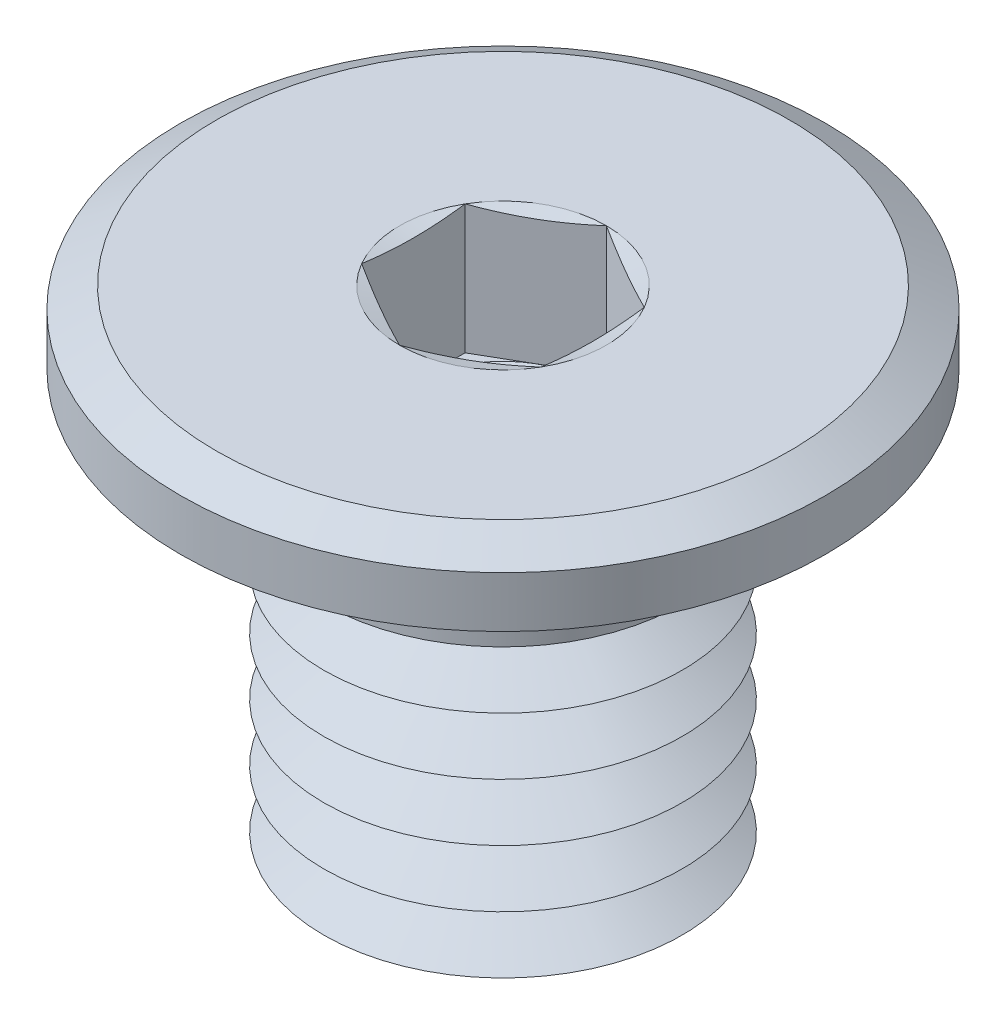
ISO-10303-21;
HEADER;
FILE_DESCRIPTION(('STEP AP214'),'2;1');
FILE_NAME('part.step','',(''),(''),'','','');
FILE_SCHEMA(('AUTOMOTIVE_DESIGN { 1 0 10303 214 1 1 1 1 }'));
ENDSEC;
DATA;
#1=APPLICATION_CONTEXT('core data for automotive mechanical design processes');
#2=APPLICATION_PROTOCOL_DEFINITION('international standard','automotive_design',2000,#1);
#3=PRODUCT_CONTEXT('',#1,'mechanical');
#4=PRODUCT('Part','Part','',(#3));
#5=PRODUCT_RELATED_PRODUCT_CATEGORY('part','',(#4));
#6=PRODUCT_DEFINITION_FORMATION('','',#4);
#7=PRODUCT_DEFINITION_CONTEXT('part definition',#1,'design');
#8=PRODUCT_DEFINITION('design','',#6,#7);
#9=PRODUCT_DEFINITION_SHAPE('','',#8);
#10=(LENGTH_UNIT() NAMED_UNIT(*) SI_UNIT(.MILLI.,.METRE.));
#11=(NAMED_UNIT(*) PLANE_ANGLE_UNIT() SI_UNIT($,.RADIAN.));
#12=(NAMED_UNIT(*) SI_UNIT($,.STERADIAN.) SOLID_ANGLE_UNIT());
#13=UNCERTAINTY_MEASURE_WITH_UNIT(LENGTH_MEASURE(1.E-05),#10,'distance_accuracy_value','');
#14=(GEOMETRIC_REPRESENTATION_CONTEXT(3) GLOBAL_UNCERTAINTY_ASSIGNED_CONTEXT((#13)) GLOBAL_UNIT_ASSIGNED_CONTEXT((#10,
#11,#12)) REPRESENTATION_CONTEXT('',''));
#15=CARTESIAN_POINT('',(0.,0.,0.));
#16=DIRECTION('',(0.,0.,1.));
#17=DIRECTION('',(1.,0.,0.));
#18=AXIS2_PLACEMENT_3D('',#15,#16,#17);
#19=CARTESIAN_POINT('',(0.,-5.8,0.));
#20=DIRECTION('',(0.,-1.,0.));
#21=DIRECTION('',(0.,0.,-1.));
#22=AXIS2_PLACEMENT_3D('',#19,#20,#21);
#23=CONICAL_SURFACE('',#22,2.5,1.0471975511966);
#24=CARTESIAN_POINT('',(0.,-5.4,0.));
#25=DIRECTION('',(0.,1.,0.));
#26=DIRECTION('',(0.,0.,1.));
#27=AXIS2_PLACEMENT_3D('',#24,#25,#26);
#28=CIRCLE('',#27,1.80717967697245);
#29=CARTESIAN_POINT('',(0.,-5.4,1.80717967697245));
#30=VERTEX_POINT('',#29);
#31=EDGE_CURVE('E403',#30,#30,#28,.T.);
#32=ORIENTED_EDGE('',*,*,#31,.F.);
#33=EDGE_LOOP('',(#32));
#34=FACE_BOUND('',#33,.T.);
#35=CARTESIAN_POINT('',(0.,-5.8,0.));
#36=DIRECTION('',(0.,1.,0.));
#37=DIRECTION('',(0.,0.,1.));
#38=AXIS2_PLACEMENT_3D('',#35,#36,#37);
#39=CIRCLE('',#38,2.5);
#40=CARTESIAN_POINT('',(0.,-5.8,2.5));
#41=VERTEX_POINT('',#40);
#42=EDGE_CURVE('E406',#41,#41,#39,.T.);
#43=ORIENTED_EDGE('',*,*,#42,.T.);
#44=EDGE_LOOP('',(#43));
#45=FACE_BOUND('',#44,.T.);
#46=ADVANCED_FACE('F39',(#34,#45),#23,.T.);
#47=CARTESIAN_POINT('',(0.,-5.4,0.));
#48=DIRECTION('',(0.,1.,0.));
#49=DIRECTION('',(0.,0.,1.));
#50=AXIS2_PLACEMENT_3D('',#47,#48,#49);
#51=CONICAL_SURFACE('',#50,1.80717967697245,1.0471975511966);
#52=CARTESIAN_POINT('',(0.,-5.,0.));
#53=DIRECTION('',(0.,1.,0.));
#54=DIRECTION('',(0.,0.,1.));
#55=AXIS2_PLACEMENT_3D('',#52,#53,#54);
#56=CIRCLE('',#55,2.5);
#57=CARTESIAN_POINT('',(0.,-5.,2.5));
#58=VERTEX_POINT('',#57);
#59=EDGE_CURVE('E399',#58,#58,#56,.T.);
#60=ORIENTED_EDGE('',*,*,#59,.F.);
#61=EDGE_LOOP('',(#60));
#62=FACE_BOUND('',#61,.T.);
#63=ORIENTED_EDGE('',*,*,#31,.T.);
#64=EDGE_LOOP('',(#63));
#65=FACE_BOUND('',#64,.T.);
#66=ADVANCED_FACE('F233',(#62,#65),#51,.T.);
#67=CARTESIAN_POINT('',(0.,-7.,0.));
#68=DIRECTION('',(0.,-1.,0.));
#69=DIRECTION('',(0.,0.,-1.));
#70=AXIS2_PLACEMENT_3D('',#67,#68,#69);
#71=PLANE('',#70);
#72=CARTESIAN_POINT('',(0.,-7.,0.));
#73=DIRECTION('',(0.,1.,0.));
#74=DIRECTION('',(0.,0.,1.));
#75=AXIS2_PLACEMENT_3D('',#72,#73,#74);
#76=CIRCLE('',#75,1.80717967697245);
#77=CARTESIAN_POINT('',(0.,-7.,1.80717967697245));
#78=VERTEX_POINT('',#77);
#79=EDGE_CURVE('E299',#78,#78,#76,.T.);
#80=ORIENTED_EDGE('',*,*,#79,.F.);
#81=EDGE_LOOP('',(#80));
#82=FACE_BOUND('',#81,.T.);
#83=ADVANCED_FACE('F239',(#82),#71,.T.);
#84=CARTESIAN_POINT('',(0.,-7.,0.));
#85=DIRECTION('',(0.,1.,0.));
#86=DIRECTION('',(0.,0.,1.));
#87=AXIS2_PLACEMENT_3D('',#84,#85,#86);
#88=CONICAL_SURFACE('',#87,1.80717967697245,1.0471975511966);
#89=CARTESIAN_POINT('',(0.,-6.6,0.));
#90=DIRECTION('',(0.,1.,0.));
#91=DIRECTION('',(0.,0.,1.));
#92=AXIS2_PLACEMENT_3D('',#89,#90,#91);
#93=CIRCLE('',#92,2.5);
#94=CARTESIAN_POINT('',(0.,-6.6,2.5));
#95=VERTEX_POINT('',#94);
#96=EDGE_CURVE('E414',#95,#95,#93,.T.);
#97=ORIENTED_EDGE('',*,*,#96,.F.);
#98=EDGE_LOOP('',(#97));
#99=FACE_BOUND('',#98,.T.);
#100=ORIENTED_EDGE('',*,*,#79,.T.);
#101=EDGE_LOOP('',(#100));
#102=FACE_BOUND('',#101,.T.);
#103=ADVANCED_FACE('F254',(#99,#102),#88,.T.);
#104=CARTESIAN_POINT('',(0.,-6.6,0.));
#105=DIRECTION('',(0.,-1.,0.));
#106=DIRECTION('',(0.,0.,-1.));
#107=AXIS2_PLACEMENT_3D('',#104,#105,#106);
#108=CONICAL_SURFACE('',#107,2.5,1.0471975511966);
#109=CARTESIAN_POINT('',(0.,-6.2,0.));
#110=DIRECTION('',(0.,1.,0.));
#111=DIRECTION('',(0.,0.,1.));
#112=AXIS2_PLACEMENT_3D('',#109,#110,#111);
#113=CIRCLE('',#112,1.80717967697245);
#114=CARTESIAN_POINT('',(0.,-6.2,1.80717967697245));
#115=VERTEX_POINT('',#114);
#116=EDGE_CURVE('E410',#115,#115,#113,.T.);
#117=ORIENTED_EDGE('',*,*,#116,.F.);
#118=EDGE_LOOP('',(#117));
#119=FACE_BOUND('',#118,.T.);
#120=ORIENTED_EDGE('',*,*,#96,.T.);
#121=EDGE_LOOP('',(#120));
#122=FACE_BOUND('',#121,.T.);
#123=ADVANCED_FACE('F250',(#119,#122),#108,.T.);
#124=CARTESIAN_POINT('',(0.,-6.2,0.));
#125=DIRECTION('',(0.,1.,0.));
#126=DIRECTION('',(0.,0.,1.));
#127=AXIS2_PLACEMENT_3D('',#124,#125,#126);
#128=CONICAL_SURFACE('',#127,1.80717967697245,1.0471975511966);
#129=ORIENTED_EDGE('',*,*,#42,.F.);
#130=EDGE_LOOP('',(#129));
#131=FACE_BOUND('',#130,.T.);
#132=ORIENTED_EDGE('',*,*,#116,.T.);
#133=EDGE_LOOP('',(#132));
#134=FACE_BOUND('',#133,.T.);
#135=ADVANCED_FACE('F246',(#131,#134),#128,.T.);
#136=CARTESIAN_POINT('',(0.,-5.,0.));
#137=DIRECTION('',(0.,-1.,0.));
#138=DIRECTION('',(0.,0.,-1.));
#139=AXIS2_PLACEMENT_3D('',#136,#137,#138);
#140=CONICAL_SURFACE('',#139,2.5,1.0471975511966);
#141=CARTESIAN_POINT('',(0.,-4.6,0.));
#142=DIRECTION('',(0.,1.,0.));
#143=DIRECTION('',(0.,0.,1.));
#144=AXIS2_PLACEMENT_3D('',#141,#142,#143);
#145=CIRCLE('',#144,1.80717967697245);
#146=CARTESIAN_POINT('',(0.,-4.6,1.80717967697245));
#147=VERTEX_POINT('',#146);
#148=EDGE_CURVE('E396',#147,#147,#145,.T.);
#149=ORIENTED_EDGE('',*,*,#148,.F.);
#150=EDGE_LOOP('',(#149));
#151=FACE_BOUND('',#150,.T.);
#152=ORIENTED_EDGE('',*,*,#59,.T.);
#153=EDGE_LOOP('',(#152));
#154=FACE_BOUND('',#153,.T.);
#155=ADVANCED_FACE('F249',(#151,#154),#140,.T.);
#156=CARTESIAN_POINT('',(0.,-4.6,0.));
#157=DIRECTION('',(0.,1.,0.));
#158=DIRECTION('',(0.,0.,1.));
#159=AXIS2_PLACEMENT_3D('',#156,#157,#158);
#160=CONICAL_SURFACE('',#159,1.80717967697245,1.0471975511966);
#161=CARTESIAN_POINT('',(0.,-4.2,0.));
#162=DIRECTION('',(0.,1.,0.));
#163=DIRECTION('',(0.,0.,1.));
#164=AXIS2_PLACEMENT_3D('',#161,#162,#163);
#165=CIRCLE('',#164,2.5);
#166=CARTESIAN_POINT('',(0.,-4.2,2.5));
#167=VERTEX_POINT('',#166);
#168=EDGE_CURVE('E392',#167,#167,#165,.T.);
#169=ORIENTED_EDGE('',*,*,#168,.F.);
#170=EDGE_LOOP('',(#169));
#171=FACE_BOUND('',#170,.T.);
#172=ORIENTED_EDGE('',*,*,#148,.T.);
#173=EDGE_LOOP('',(#172));
#174=FACE_BOUND('',#173,.T.);
#175=ADVANCED_FACE('F491',(#171,#174),#160,.T.);
#176=CARTESIAN_POINT('',(0.,-4.2,0.));
#177=DIRECTION('',(0.,-1.,0.));
#178=DIRECTION('',(0.,0.,-1.));
#179=AXIS2_PLACEMENT_3D('',#176,#177,#178);
#180=CONICAL_SURFACE('',#179,2.5,1.0471975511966);
#181=CARTESIAN_POINT('',(0.,-3.8,0.));
#182=DIRECTION('',(0.,1.,0.));
#183=DIRECTION('',(0.,0.,1.));
#184=AXIS2_PLACEMENT_3D('',#181,#182,#183);
#185=CIRCLE('',#184,1.80717967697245);
#186=CARTESIAN_POINT('',(0.,-3.8,1.80717967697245));
#187=VERTEX_POINT('',#186);
#188=EDGE_CURVE('E388',#187,#187,#185,.T.);
#189=ORIENTED_EDGE('',*,*,#188,.F.);
#190=EDGE_LOOP('',(#189));
#191=FACE_BOUND('',#190,.T.);
#192=ORIENTED_EDGE('',*,*,#168,.T.);
#193=EDGE_LOOP('',(#192));
#194=FACE_BOUND('',#193,.T.);
#195=ADVANCED_FACE('F487',(#191,#194),#180,.T.);
#196=CARTESIAN_POINT('',(0.,-3.8,0.));
#197=DIRECTION('',(0.,1.,0.));
#198=DIRECTION('',(0.,0.,1.));
#199=AXIS2_PLACEMENT_3D('',#196,#197,#198);
#200=CONICAL_SURFACE('',#199,1.80717967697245,1.0471975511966);
#201=CARTESIAN_POINT('',(0.,-3.4,0.));
#202=DIRECTION('',(0.,1.,0.));
#203=DIRECTION('',(0.,0.,1.));
#204=AXIS2_PLACEMENT_3D('',#201,#202,#203);
#205=CIRCLE('',#204,2.5);
#206=CARTESIAN_POINT('',(0.,-3.4,2.5));
#207=VERTEX_POINT('',#206);
#208=EDGE_CURVE('E384',#207,#207,#205,.T.);
#209=ORIENTED_EDGE('',*,*,#208,.F.);
#210=EDGE_LOOP('',(#209));
#211=FACE_BOUND('',#210,.T.);
#212=ORIENTED_EDGE('',*,*,#188,.T.);
#213=EDGE_LOOP('',(#212));
#214=FACE_BOUND('',#213,.T.);
#215=ADVANCED_FACE('F483',(#211,#214),#200,.T.);
#216=CARTESIAN_POINT('',(0.,-3.4,0.));
#217=DIRECTION('',(0.,-1.,0.));
#218=DIRECTION('',(0.,0.,-1.));
#219=AXIS2_PLACEMENT_3D('',#216,#217,#218);
#220=CONICAL_SURFACE('',#219,2.5,1.0471975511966);
#221=CARTESIAN_POINT('',(0.,-3.,0.));
#222=DIRECTION('',(0.,1.,0.));
#223=DIRECTION('',(0.,0.,1.));
#224=AXIS2_PLACEMENT_3D('',#221,#222,#223);
#225=CIRCLE('',#224,1.80717967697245);
#226=CARTESIAN_POINT('',(0.,-3.,1.80717967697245));
#227=VERTEX_POINT('',#226);
#228=EDGE_CURVE('E380',#227,#227,#225,.T.);
#229=ORIENTED_EDGE('',*,*,#228,.F.);
#230=EDGE_LOOP('',(#229));
#231=FACE_BOUND('',#230,.T.);
#232=ORIENTED_EDGE('',*,*,#208,.T.);
#233=EDGE_LOOP('',(#232));
#234=FACE_BOUND('',#233,.T.);
#235=ADVANCED_FACE('F479',(#231,#234),#220,.T.);
#236=CARTESIAN_POINT('',(0.,-3.,0.));
#237=DIRECTION('',(0.,1.,0.));
#238=DIRECTION('',(0.,0.,1.));
#239=AXIS2_PLACEMENT_3D('',#236,#237,#238);
#240=CONICAL_SURFACE('',#239,1.80717967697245,1.0471975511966);
#241=CARTESIAN_POINT('',(0.,-2.6,0.));
#242=DIRECTION('',(0.,1.,0.));
#243=DIRECTION('',(0.,0.,1.));
#244=AXIS2_PLACEMENT_3D('',#241,#242,#243);
#245=CIRCLE('',#244,2.5);
#246=CARTESIAN_POINT('',(0.,-2.6,2.5));
#247=VERTEX_POINT('',#246);
#248=EDGE_CURVE('E364',#247,#247,#245,.T.);
#249=ORIENTED_EDGE('',*,*,#248,.F.);
#250=EDGE_LOOP('',(#249));
#251=FACE_BOUND('',#250,.T.);
#252=ORIENTED_EDGE('',*,*,#228,.T.);
#253=EDGE_LOOP('',(#252));
#254=FACE_BOUND('',#253,.T.);
#255=ADVANCED_FACE('F274',(#251,#254),#240,.T.);
#256=CARTESIAN_POINT('',(0.,0.,0.));
#257=DIRECTION('',(0.,1.,0.));
#258=DIRECTION('',(0.,0.,1.));
#259=AXIS2_PLACEMENT_3D('',#256,#257,#258);
#260=PLANE('',#259);
#261=CARTESIAN_POINT('',(0.,0.,0.));
#262=DIRECTION('',(0.,1.,0.));
#263=DIRECTION('',(0.,0.,1.));
#264=AXIS2_PLACEMENT_3D('',#261,#262,#263);
#265=CIRCLE('',#264,1.44337567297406);
#266=CARTESIAN_POINT('',(0.,0.,1.44337567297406));
#267=VERTEX_POINT('',#266);
#268=CARTESIAN_POINT('',(1.25,0.,0.721687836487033));
#269=VERTEX_POINT('',#268);
#270=EDGE_CURVE('E66',#267,#269,#265,.T.);
#271=ORIENTED_EDGE('',*,*,#270,.F.);
#272=CARTESIAN_POINT('',(-1.25,0.,0.721687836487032));
#273=VERTEX_POINT('',#272);
#274=EDGE_CURVE('E169',#273,#267,#265,.T.);
#275=ORIENTED_EDGE('',*,*,#274,.F.);
#276=CARTESIAN_POINT('',(-1.25,0.,-0.721687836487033));
#277=VERTEX_POINT('',#276);
#278=EDGE_CURVE('E164',#277,#273,#265,.T.);
#279=ORIENTED_EDGE('',*,*,#278,.F.);
#280=CARTESIAN_POINT('',(0.,0.,-1.44337567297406));
#281=VERTEX_POINT('',#280);
#282=EDGE_CURVE('E128',#281,#277,#265,.T.);
#283=ORIENTED_EDGE('',*,*,#282,.F.);
#284=CARTESIAN_POINT('',(1.25,0.,-0.721687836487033));
#285=VERTEX_POINT('',#284);
#286=EDGE_CURVE('E119',#285,#281,#265,.T.);
#287=ORIENTED_EDGE('',*,*,#286,.F.);
#288=EDGE_CURVE('E59',#269,#285,#265,.T.);
#289=ORIENTED_EDGE('',*,*,#288,.F.);
#290=EDGE_LOOP('',(#271,#275,#279,#283,#287,#289));
#291=FACE_BOUND('',#290,.T.);
#292=CARTESIAN_POINT('',(0.,0.,0.));
#293=DIRECTION('',(0.,1.,0.));
#294=DIRECTION('',(0.,0.,1.));
#295=AXIS2_PLACEMENT_3D('',#292,#293,#294);
#296=CIRCLE('',#295,3.99999999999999);
#297=CARTESIAN_POINT('',(0.,0.,3.99999999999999));
#298=VERTEX_POINT('',#297);
#299=EDGE_CURVE('E295',#298,#298,#296,.T.);
#300=ORIENTED_EDGE('',*,*,#299,.T.);
#301=EDGE_LOOP('',(#300));
#302=FACE_BOUND('',#301,.T.);
#303=ADVANCED_FACE('F160',(#291,#302),#260,.T.);
#304=CARTESIAN_POINT('',(0.,-1.,0.));
#305=DIRECTION('',(0.,1.,0.));
#306=DIRECTION('',(0.,0.,1.));
#307=AXIS2_PLACEMENT_3D('',#304,#305,#306);
#308=CYLINDRICAL_SURFACE('',#307,4.5);
#309=CARTESIAN_POINT('',(0.,-0.288675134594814,0.));
#310=DIRECTION('',(0.,1.,0.));
#311=DIRECTION('',(0.,0.,1.));
#312=AXIS2_PLACEMENT_3D('',#309,#310,#311);
#313=CIRCLE('',#312,4.5);
#314=CARTESIAN_POINT('',(0.,-0.288675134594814,4.5));
#315=VERTEX_POINT('',#314);
#316=EDGE_CURVE('E306',#315,#315,#313,.F.);
#317=ORIENTED_EDGE('',*,*,#316,.T.);
#318=EDGE_LOOP('',(#317));
#319=FACE_BOUND('',#318,.T.);
#320=CARTESIAN_POINT('',(0.,-1.,0.));
#321=DIRECTION('',(0.,1.,0.));
#322=DIRECTION('',(0.,0.,1.));
#323=AXIS2_PLACEMENT_3D('',#320,#321,#322);
#324=CIRCLE('',#323,4.5);
#325=CARTESIAN_POINT('',(0.,-1.,4.5));
#326=VERTEX_POINT('',#325);
#327=EDGE_CURVE('E291',#326,#326,#324,.T.);
#328=ORIENTED_EDGE('',*,*,#327,.T.);
#329=EDGE_LOOP('',(#328));
#330=FACE_BOUND('',#329,.T.);
#331=ADVANCED_FACE('F270',(#319,#330),#308,.T.);
#332=CARTESIAN_POINT('',(0.,-1.,0.));
#333=DIRECTION('',(0.,1.,0.));
#334=DIRECTION('',(0.,0.,1.));
#335=AXIS2_PLACEMENT_3D('',#332,#333,#334);
#336=PLANE('',#335);
#337=CARTESIAN_POINT('',(0.,-1.,0.));
#338=DIRECTION('',(0.,1.,0.));
#339=DIRECTION('',(0.,0.,1.));
#340=AXIS2_PLACEMENT_3D('',#337,#338,#339);
#341=CIRCLE('',#340,2.7);
#342=CARTESIAN_POINT('',(0.,-1.,2.7));
#343=VERTEX_POINT('',#342);
#344=EDGE_CURVE('E286',#343,#343,#341,.T.);
#345=ORIENTED_EDGE('',*,*,#344,.T.);
#346=EDGE_LOOP('',(#345));
#347=FACE_BOUND('',#346,.T.);
#348=ORIENTED_EDGE('',*,*,#327,.F.);
#349=EDGE_LOOP('',(#348));
#350=FACE_BOUND('',#349,.T.);
#351=ADVANCED_FACE('F266',(#347,#350),#336,.F.);
#352=CARTESIAN_POINT('',(0.,-7.,0.));
#353=DIRECTION('',(0.,1.,0.));
#354=DIRECTION('',(0.,0.,1.));
#355=AXIS2_PLACEMENT_3D('',#352,#353,#354);
#356=CYLINDRICAL_SURFACE('',#355,2.5);
#357=CARTESIAN_POINT('',(0.,-1.2,0.));
#358=DIRECTION('',(0.,1.,0.));
#359=DIRECTION('',(0.,0.,1.));
#360=AXIS2_PLACEMENT_3D('',#357,#358,#359);
#361=CIRCLE('',#360,2.5);
#362=CARTESIAN_POINT('',(0.,-1.2,2.5));
#363=VERTEX_POINT('',#362);
#364=EDGE_CURVE('E289',#363,#363,#361,.F.);
#365=ORIENTED_EDGE('',*,*,#364,.T.);
#366=EDGE_LOOP('',(#365));
#367=FACE_BOUND('',#366,.T.);
#368=ORIENTED_EDGE('',*,*,#248,.T.);
#369=EDGE_LOOP('',(#368));
#370=FACE_BOUND('',#369,.T.);
#371=ADVANCED_FACE('F262',(#367,#370),#356,.T.);
#372=CARTESIAN_POINT('',(0.,-1.2,0.));
#373=DIRECTION('',(0.,1.,0.));
#374=DIRECTION('',(0.,0.,1.));
#375=AXIS2_PLACEMENT_3D('',#372,#373,#374);
#376=TOROIDAL_SURFACE('',#375,2.7,0.2);
#377=ORIENTED_EDGE('',*,*,#344,.F.);
#378=EDGE_LOOP('',(#377));
#379=FACE_BOUND('',#378,.T.);
#380=ORIENTED_EDGE('',*,*,#364,.F.);
#381=EDGE_LOOP('',(#380));
#382=FACE_BOUND('',#381,.T.);
#383=ADVANCED_FACE('F265',(#379,#382),#376,.F.);
#384=CARTESIAN_POINT('',(0.,0.,0.));
#385=DIRECTION('',(0.,-1.,0.));
#386=DIRECTION('',(0.,0.,-1.));
#387=AXIS2_PLACEMENT_3D('',#384,#385,#386);
#388=CONICAL_SURFACE('',#387,3.99999999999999,1.0471975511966);
#389=ORIENTED_EDGE('',*,*,#316,.F.);
#390=EDGE_LOOP('',(#389));
#391=FACE_BOUND('',#390,.T.);
#392=ORIENTED_EDGE('',*,*,#299,.F.);
#393=EDGE_LOOP('',(#392));
#394=FACE_BOUND('',#393,.T.);
#395=ADVANCED_FACE('F41',(#391,#394),#388,.T.);
#396=CARTESIAN_POINT('',(0.,0.,0.));
#397=DIRECTION('',(0.,1.,0.));
#398=DIRECTION('',(0.,0.,1.));
#399=AXIS2_PLACEMENT_3D('',#396,#397,#398);
#400=CONICAL_SURFACE('',#399,1.44337567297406,1.30899693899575);
#401=ORIENTED_EDGE('',*,*,#282,.T.);
#402=CARTESIAN_POINT('',(0.000199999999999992,3.094382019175E-05,-1.4434911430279));
#403=CARTESIAN_POINT('',(-0.0517259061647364,-0.00800698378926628,-1.41351170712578));
#404=CARTESIAN_POINT('',(-0.103745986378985,-0.0153042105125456,-1.38347789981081));
#405=CARTESIAN_POINT('',(-0.207969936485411,-0.028124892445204,-1.32330417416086));
#406=CARTESIAN_POINT('',(-0.260173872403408,-0.0336476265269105,-1.29316421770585));
#407=CARTESIAN_POINT('',(-0.36444888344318,-0.0425967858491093,-1.23296101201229));
#408=CARTESIAN_POINT('',(-0.416519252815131,-0.0460338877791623,-1.20289817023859));
#409=CARTESIAN_POINT('',(-0.520726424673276,-0.0506427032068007,-1.1427341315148));
#410=CARTESIAN_POINT('',(-0.572863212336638,-0.0518148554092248,-1.11263294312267));
#411=CARTESIAN_POINT('',(-0.677136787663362,-0.0518148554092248,-1.05243056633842));
#412=CARTESIAN_POINT('',(-0.729273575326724,-0.0506427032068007,-1.0223293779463));
#413=CARTESIAN_POINT('',(-0.833480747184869,-0.0460338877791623,-0.96216533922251));
#414=CARTESIAN_POINT('',(-0.88555111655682,-0.0425967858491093,-0.932102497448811));
#415=CARTESIAN_POINT('',(-0.989826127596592,-0.0336476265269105,-0.871899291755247));
#416=CARTESIAN_POINT('',(-1.04203006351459,-0.028124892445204,-0.841759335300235));
#417=CARTESIAN_POINT('',(-1.14625401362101,-0.0153042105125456,-0.781585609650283));
#418=CARTESIAN_POINT('',(-1.19827409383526,-0.0080069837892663,-0.751551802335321));
#419=CARTESIAN_POINT('',(-1.2502,3.09438201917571E-05,-0.721572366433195));
#420=B_SPLINE_CURVE_WITH_KNOTS('',3,(#402,#403,#404,#405,#406,#407,#408,#409,#410,#411,#412,
#413,#414,#415,#416,#417,#418,#419),.UNSPECIFIED.,.F.,.F.,(4,2,2,2,2,2,2,2,4),(0.,
0.18149525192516,0.363064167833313,0.543695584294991,0.724292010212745,0.904888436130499,
1.08551985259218,1.26708876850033,1.44858402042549),.UNSPECIFIED.);
#421=EDGE_CURVE('E11',#281,#277,#420,.T.);
#422=ORIENTED_EDGE('',*,*,#421,.F.);
#423=EDGE_LOOP('',(#401,#422));
#424=FACE_BOUND('',#423,.T.);
#425=ADVANCED_FACE('F132',(#424),#400,.F.);
#426=ORIENTED_EDGE('',*,*,#278,.T.);
#427=CARTESIAN_POINT('',(-1.25,0.295017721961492,-2.21618029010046));
#428=CARTESIAN_POINT('',(-1.25,0.270123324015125,-2.10936606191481));
#429=CARTESIAN_POINT('',(-1.25,0.245578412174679,-2.00246488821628));
#430=CARTESIAN_POINT('',(-1.25,0.197670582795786,-1.78837821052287));
#431=CARTESIAN_POINT('',(-1.25,0.174307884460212,-1.6811926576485));
#432=CARTESIAN_POINT('',(-1.25,0.129037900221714,-1.46542158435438));
#433=CARTESIAN_POINT('',(-1.25,0.107146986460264,-1.35683258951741));
#434=CARTESIAN_POINT('',(-1.25,0.0659326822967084,-1.13914880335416));
#435=CARTESIAN_POINT('',(-1.25,0.0466095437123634,-1.03005396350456));
#436=CARTESIAN_POINT('',(-1.25,0.0123179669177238,-0.814238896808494));
#437=CARTESIAN_POINT('',(-1.25,-0.00275558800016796,-0.707535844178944));
#438=CARTESIAN_POINT('',(-1.25,-0.0275791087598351,-0.493517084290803));
#439=CARTESIAN_POINT('',(-1.25,-0.0373307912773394,-0.386201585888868));
#440=CARTESIAN_POINT('',(-1.25,-0.0498256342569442,-0.171630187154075));
#441=CARTESIAN_POINT('',(-1.25,-0.052600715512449,-0.064376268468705));
#442=CARTESIAN_POINT('',(-1.25,-0.0506356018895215,0.15006745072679));
#443=CARTESIAN_POINT('',(-1.25,-0.0458948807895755,0.257257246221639));
#444=CARTESIAN_POINT('',(-1.25,-0.0320967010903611,0.441548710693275));
#445=CARTESIAN_POINT('',(-1.25,-0.0245948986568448,0.518776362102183));
#446=CARTESIAN_POINT('',(-1.25,-0.0068236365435,0.672906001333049));
#447=CARTESIAN_POINT('',(-1.25,0.00344575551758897,0.749807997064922));
#448=CARTESIAN_POINT('',(-1.25,0.0261652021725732,0.903544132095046));
#449=CARTESIAN_POINT('',(-1.25,0.0386223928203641,0.980377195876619));
#450=CARTESIAN_POINT('',(-1.25,0.0651615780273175,1.13376313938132));
#451=CARTESIAN_POINT('',(-1.25,0.0792436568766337,1.21031600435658));
#452=CARTESIAN_POINT('',(-1.25,0.108934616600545,1.36480056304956));
#453=CARTESIAN_POINT('',(-1.25,0.124569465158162,1.44272722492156));
#454=CARTESIAN_POINT('',(-1.25,0.156788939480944,1.59838383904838));
#455=CARTESIAN_POINT('',(-1.25,0.173373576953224,1.67611378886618));
#456=CARTESIAN_POINT('',(-1.25,0.2071623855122,1.83097242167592));
#457=CARTESIAN_POINT('',(-1.25,0.224362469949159,1.90810200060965));
#458=CARTESIAN_POINT('',(-1.25,0.259314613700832,2.06223034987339));
#459=CARTESIAN_POINT('',(-1.25,0.277066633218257,2.13922912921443));
#460=CARTESIAN_POINT('',(-1.25,0.295017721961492,2.21618029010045));
#461=B_SPLINE_CURVE_WITH_KNOTS('',3,(#427,#428,#429,#430,#431,#432,#433,#434,#435,#436,#437,
#438,#439,#440,#441,#442,#443,#444,#445,#446,#447,#448,#449,#450,#451,#452,#453,#454,#455,#456,
#457,#458,#459,#460),.UNSPECIFIED.,.F.,.F.,(4,2,2,2,2,2,2,2,2,2,2,2,2,2,2,2,4),(0.,
0.329038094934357,0.658136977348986,0.990437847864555,1.32277128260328,1.64596801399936,
1.96906043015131,2.29067185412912,2.61230579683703,2.84502466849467,3.07773785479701,
3.3112246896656,3.54472364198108,3.78315484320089,4.02158898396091,4.2586591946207,
4.49571235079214),.UNSPECIFIED.);
#462=EDGE_CURVE('E172',#277,#273,#461,.T.);
#463=ORIENTED_EDGE('',*,*,#462,.F.);
#464=EDGE_LOOP('',(#426,#463));
#465=FACE_BOUND('',#464,.T.);
#466=ADVANCED_FACE('F438',(#465),#400,.F.);
#467=ORIENTED_EDGE('',*,*,#274,.T.);
#468=CARTESIAN_POINT('',(-1.2502,3.09438201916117E-05,0.721572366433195));
#469=CARTESIAN_POINT('',(-1.19827409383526,-0.00800698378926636,0.75155180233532));
#470=CARTESIAN_POINT('',(-1.14625401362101,-0.0153042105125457,0.781585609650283));
#471=CARTESIAN_POINT('',(-1.04203006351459,-0.0281248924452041,0.841759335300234));
#472=CARTESIAN_POINT('',(-0.989826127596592,-0.0336476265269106,0.871899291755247));
#473=CARTESIAN_POINT('',(-0.88555111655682,-0.0425967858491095,0.932102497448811));
#474=CARTESIAN_POINT('',(-0.833480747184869,-0.0460338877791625,0.96216533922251));
#475=CARTESIAN_POINT('',(-0.729273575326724,-0.0506427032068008,1.0223293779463));
#476=CARTESIAN_POINT('',(-0.677136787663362,-0.051814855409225,1.05243056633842));
#477=CARTESIAN_POINT('',(-0.572863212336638,-0.0518148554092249,1.11263294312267));
#478=CARTESIAN_POINT('',(-0.520726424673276,-0.0506427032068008,1.1427341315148));
#479=CARTESIAN_POINT('',(-0.416519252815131,-0.0460338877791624,1.20289817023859));
#480=CARTESIAN_POINT('',(-0.36444888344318,-0.0425967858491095,1.23296101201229));
#481=CARTESIAN_POINT('',(-0.260173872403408,-0.0336476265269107,1.29316421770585));
#482=CARTESIAN_POINT('',(-0.207969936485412,-0.0281248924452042,1.32330417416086));
#483=CARTESIAN_POINT('',(-0.103745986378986,-0.0153042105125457,1.38347789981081));
#484=CARTESIAN_POINT('',(-0.0517259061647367,-0.00800698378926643,1.41351170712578));
#485=CARTESIAN_POINT('',(0.000199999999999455,3.09438201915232E-05,1.4434911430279));
#486=B_SPLINE_CURVE_WITH_KNOTS('',3,(#468,#469,#470,#471,#472,#473,#474,#475,#476,#477,#478,
#479,#480,#481,#482,#483,#484,#485),.UNSPECIFIED.,.F.,.F.,(4,2,2,2,2,2,2,2,4),(0.,
0.18149525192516,0.363064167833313,0.543695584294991,0.724292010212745,0.904888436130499,
1.08551985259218,1.26708876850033,1.44858402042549),.UNSPECIFIED.);
#487=EDGE_CURVE('E180',#273,#267,#486,.T.);
#488=ORIENTED_EDGE('',*,*,#487,.F.);
#489=EDGE_LOOP('',(#467,#488));
#490=FACE_BOUND('',#489,.T.);
#491=ADVANCED_FACE('F436',(#490),#400,.F.);
#492=ORIENTED_EDGE('',*,*,#270,.T.);
#493=CARTESIAN_POINT('',(-0.00020000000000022,3.09438201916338E-05,1.4434911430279));
#494=CARTESIAN_POINT('',(0.0517259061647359,-0.00800698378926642,1.41351170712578));
#495=CARTESIAN_POINT('',(0.103745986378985,-0.0153042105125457,1.38347789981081));
#496=CARTESIAN_POINT('',(0.207969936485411,-0.0281248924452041,1.32330417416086));
#497=CARTESIAN_POINT('',(0.260173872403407,-0.0336476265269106,1.29316421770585));
#498=CARTESIAN_POINT('',(0.36444888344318,-0.0425967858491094,1.23296101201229));
#499=CARTESIAN_POINT('',(0.416519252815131,-0.0460338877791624,1.20289817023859));
#500=CARTESIAN_POINT('',(0.520726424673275,-0.0506427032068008,1.1427341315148));
#501=CARTESIAN_POINT('',(0.572863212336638,-0.0518148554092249,1.11263294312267));
#502=CARTESIAN_POINT('',(0.677136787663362,-0.0518148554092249,1.05243056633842));
#503=CARTESIAN_POINT('',(0.729273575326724,-0.0506427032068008,1.0223293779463));
#504=CARTESIAN_POINT('',(0.833480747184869,-0.0460338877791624,0.96216533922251));
#505=CARTESIAN_POINT('',(0.88555111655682,-0.0425967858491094,0.932102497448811));
#506=CARTESIAN_POINT('',(0.989826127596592,-0.0336476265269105,0.871899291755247));
#507=CARTESIAN_POINT('',(1.04203006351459,-0.028124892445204,0.841759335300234));
#508=CARTESIAN_POINT('',(1.14625401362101,-0.0153042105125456,0.781585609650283));
#509=CARTESIAN_POINT('',(1.19827409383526,-0.00800698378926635,0.751551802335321));
#510=CARTESIAN_POINT('',(1.2502,3.09438201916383E-05,0.721572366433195));
#511=B_SPLINE_CURVE_WITH_KNOTS('',3,(#493,#494,#495,#496,#497,#498,#499,#500,#501,#502,#503,
#504,#505,#506,#507,#508,#509,#510),.UNSPECIFIED.,.F.,.F.,(4,2,2,2,2,2,2,2,4),(0.,
0.18149525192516,0.363064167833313,0.543695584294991,0.724292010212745,0.904888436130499,
1.08551985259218,1.26708876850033,1.44858402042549),.UNSPECIFIED.);
#512=EDGE_CURVE('E199',#267,#269,#511,.T.);
#513=ORIENTED_EDGE('',*,*,#512,.F.);
#514=EDGE_LOOP('',(#492,#513));
#515=FACE_BOUND('',#514,.T.);
#516=ADVANCED_FACE('F561',(#515),#400,.F.);
#517=ORIENTED_EDGE('',*,*,#288,.T.);
#518=CARTESIAN_POINT('',(1.25,0.295017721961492,2.21618029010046));
#519=CARTESIAN_POINT('',(1.25,0.270123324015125,2.10936606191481));
#520=CARTESIAN_POINT('',(1.25,0.245578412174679,2.00246488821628));
#521=CARTESIAN_POINT('',(1.25,0.197670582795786,1.78837821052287));
#522=CARTESIAN_POINT('',(1.25,0.174307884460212,1.6811926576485));
#523=CARTESIAN_POINT('',(1.25,0.129037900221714,1.46542158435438));
#524=CARTESIAN_POINT('',(1.25,0.107146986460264,1.35683258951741));
#525=CARTESIAN_POINT('',(1.25,0.0659326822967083,1.13914880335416));
#526=CARTESIAN_POINT('',(1.25,0.0466095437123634,1.03005396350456));
#527=CARTESIAN_POINT('',(1.25,0.0123179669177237,0.814238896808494));
#528=CARTESIAN_POINT('',(1.25,-0.00275558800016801,0.707535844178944));
#529=CARTESIAN_POINT('',(1.25,-0.0275791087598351,0.493517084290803));
#530=CARTESIAN_POINT('',(1.25,-0.0373307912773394,0.386201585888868));
#531=CARTESIAN_POINT('',(1.25,-0.0498256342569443,0.171630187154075));
#532=CARTESIAN_POINT('',(1.25,-0.052600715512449,0.064376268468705));
#533=CARTESIAN_POINT('',(1.25,-0.0506356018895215,-0.15006745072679));
#534=CARTESIAN_POINT('',(1.25,-0.0458948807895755,-0.257257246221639));
#535=CARTESIAN_POINT('',(1.25,-0.0320967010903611,-0.441548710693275));
#536=CARTESIAN_POINT('',(1.25,-0.0245948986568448,-0.518776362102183));
#537=CARTESIAN_POINT('',(1.25,-0.0068236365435,-0.672906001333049));
#538=CARTESIAN_POINT('',(1.25,0.00344575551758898,-0.749807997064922));
#539=CARTESIAN_POINT('',(1.25,0.0261652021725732,-0.903544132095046));
#540=CARTESIAN_POINT('',(1.25,0.0386223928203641,-0.980377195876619));
#541=CARTESIAN_POINT('',(1.25,0.0651615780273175,-1.13376313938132));
#542=CARTESIAN_POINT('',(1.25,0.0792436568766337,-1.21031600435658));
#543=CARTESIAN_POINT('',(1.25,0.108934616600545,-1.36480056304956));
#544=CARTESIAN_POINT('',(1.25,0.124569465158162,-1.44272722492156));
#545=CARTESIAN_POINT('',(1.25,0.156788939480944,-1.59838383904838));
#546=CARTESIAN_POINT('',(1.25,0.173373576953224,-1.67611378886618));
#547=CARTESIAN_POINT('',(1.25,0.2071623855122,-1.83097242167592));
#548=CARTESIAN_POINT('',(1.25,0.224362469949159,-1.90810200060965));
#549=CARTESIAN_POINT('',(1.25,0.259314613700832,-2.06223034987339));
#550=CARTESIAN_POINT('',(1.25,0.277066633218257,-2.13922912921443));
#551=CARTESIAN_POINT('',(1.25,0.295017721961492,-2.21618029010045));
#552=B_SPLINE_CURVE_WITH_KNOTS('',3,(#518,#519,#520,#521,#522,#523,#524,#525,#526,#527,#528,
#529,#530,#531,#532,#533,#534,#535,#536,#537,#538,#539,#540,#541,#542,#543,#544,#545,#546,#547,
#548,#549,#550,#551),.UNSPECIFIED.,.F.,.F.,(4,2,2,2,2,2,2,2,2,2,2,2,2,2,2,2,4),(0.,
0.329038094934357,0.658136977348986,0.990437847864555,1.32277128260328,1.64596801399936,
1.96906043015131,2.29067185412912,2.61230579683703,2.84502466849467,3.07773785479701,
3.3112246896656,3.54472364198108,3.78315484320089,4.02158898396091,4.2586591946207,
4.49571235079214),.UNSPECIFIED.);
#553=EDGE_CURVE('E149',#269,#285,#552,.T.);
#554=ORIENTED_EDGE('',*,*,#553,.F.);
#555=EDGE_LOOP('',(#517,#554));
#556=FACE_BOUND('',#555,.T.);
#557=ADVANCED_FACE('F192',(#556),#400,.F.);
#558=ORIENTED_EDGE('',*,*,#286,.T.);
#559=CARTESIAN_POINT('',(1.2502,3.09438201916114E-05,-0.721572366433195));
#560=CARTESIAN_POINT('',(1.19827409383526,-0.00800698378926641,-0.75155180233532));
#561=CARTESIAN_POINT('',(1.14625401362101,-0.0153042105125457,-0.781585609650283));
#562=CARTESIAN_POINT('',(1.04203006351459,-0.0281248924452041,-0.841759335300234));
#563=CARTESIAN_POINT('',(0.989826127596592,-0.0336476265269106,-0.871899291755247));
#564=CARTESIAN_POINT('',(0.88555111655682,-0.0425967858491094,-0.932102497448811));
#565=CARTESIAN_POINT('',(0.833480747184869,-0.0460338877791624,-0.96216533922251));
#566=CARTESIAN_POINT('',(0.729273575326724,-0.0506427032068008,-1.0223293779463));
#567=CARTESIAN_POINT('',(0.677136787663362,-0.0518148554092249,-1.05243056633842));
#568=CARTESIAN_POINT('',(0.572863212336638,-0.0518148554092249,-1.11263294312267));
#569=CARTESIAN_POINT('',(0.520726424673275,-0.0506427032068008,-1.1427341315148));
#570=CARTESIAN_POINT('',(0.416519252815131,-0.0460338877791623,-1.20289817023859));
#571=CARTESIAN_POINT('',(0.36444888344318,-0.0425967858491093,-1.23296101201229));
#572=CARTESIAN_POINT('',(0.260173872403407,-0.0336476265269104,-1.29316421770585));
#573=CARTESIAN_POINT('',(0.207969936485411,-0.0281248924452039,-1.32330417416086));
#574=CARTESIAN_POINT('',(0.103745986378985,-0.0153042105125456,-1.38347789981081));
#575=CARTESIAN_POINT('',(0.051725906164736,-0.00800698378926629,-1.41351170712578));
#576=CARTESIAN_POINT('',(-0.000200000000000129,3.0943820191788E-05,-1.4434911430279));
#577=B_SPLINE_CURVE_WITH_KNOTS('',3,(#559,#560,#561,#562,#563,#564,#565,#566,#567,#568,#569,
#570,#571,#572,#573,#574,#575,#576),.UNSPECIFIED.,.F.,.F.,(4,2,2,2,2,2,2,2,4),(0.,
0.18149525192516,0.363064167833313,0.543695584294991,0.724292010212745,0.9048884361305,
1.08551985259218,1.26708876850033,1.44858402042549),.UNSPECIFIED.);
#578=EDGE_CURVE('E123',#285,#281,#577,.T.);
#579=ORIENTED_EDGE('',*,*,#578,.F.);
#580=EDGE_LOOP('',(#558,#579));
#581=FACE_BOUND('',#580,.T.);
#582=ADVANCED_FACE('F121',(#581),#400,.F.);
#583=CARTESIAN_POINT('',(0.,-1.8,0.));
#584=DIRECTION('',(0.,1.,0.));
#585=DIRECTION('',(0.,0.,1.));
#586=AXIS2_PLACEMENT_3D('',#583,#584,#585);
#587=CONICAL_SURFACE('',#586,1.25,1.0471975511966);
#588=CARTESIAN_POINT('',(0.,-2.52168783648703,0.));
#589=VERTEX_POINT('',#588);
#590=VERTEX_LOOP('',#589);
#591=FACE_BOUND('',#590,.T.);
#592=CARTESIAN_POINT('',(0.,-1.8,0.));
#593=DIRECTION('',(0.,1.,0.));
#594=DIRECTION('',(0.,0.,1.));
#595=AXIS2_PLACEMENT_3D('',#592,#593,#594);
#596=CIRCLE('',#595,1.25);
#597=CARTESIAN_POINT('',(0.624999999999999,-1.8,1.08253175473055));
#598=VERTEX_POINT('',#597);
#599=CARTESIAN_POINT('',(1.25,-1.8,0.));
#600=VERTEX_POINT('',#599);
#601=EDGE_CURVE('E148',#598,#600,#596,.T.);
#602=ORIENTED_EDGE('',*,*,#601,.T.);
#603=CARTESIAN_POINT('',(0.,-1.8,0.));
#604=DIRECTION('',(0.,1.,0.));
#605=DIRECTION('',(0.,0.,1.));
#606=AXIS2_PLACEMENT_3D('',#603,#604,#605);
#607=CIRCLE('',#606,1.25);
#608=CARTESIAN_POINT('',(0.625,-1.8,-1.08253175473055));
#609=VERTEX_POINT('',#608);
#610=EDGE_CURVE('E53',#600,#609,#607,.T.);
#611=ORIENTED_EDGE('',*,*,#610,.T.);
#612=CARTESIAN_POINT('',(-0.625,-1.8,-1.08253175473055));
#613=VERTEX_POINT('',#612);
#614=EDGE_CURVE('E320',#609,#613,#607,.T.);
#615=ORIENTED_EDGE('',*,*,#614,.T.);
#616=CARTESIAN_POINT('',(-1.25,-1.8,0.));
#617=VERTEX_POINT('',#616);
#618=EDGE_CURVE('E318',#613,#617,#607,.T.);
#619=ORIENTED_EDGE('',*,*,#618,.T.);
#620=CARTESIAN_POINT('',(-0.625,-1.8,1.08253175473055));
#621=VERTEX_POINT('',#620);
#622=EDGE_CURVE('E311',#617,#621,#607,.T.);
#623=ORIENTED_EDGE('',*,*,#622,.T.);
#624=EDGE_CURVE('E309',#621,#598,#607,.T.);
#625=ORIENTED_EDGE('',*,*,#624,.T.);
#626=EDGE_LOOP('',(#602,#611,#615,#619,#623,#625));
#627=FACE_BOUND('',#626,.T.);
#628=ADVANCED_FACE('F191',(#591,#627),#587,.F.);
#629=CARTESIAN_POINT('',(0.,-1.8,0.));
#630=DIRECTION('',(0.,1.,0.));
#631=DIRECTION('',(0.,0.,1.));
#632=AXIS2_PLACEMENT_3D('',#629,#630,#631);
#633=PLANE('',#632);
#634=ORIENTED_EDGE('',*,*,#610,.F.);
#635=DIRECTION('',(0.,0.,-1.));
#636=VECTOR('',#635,1.);
#637=CARTESIAN_POINT('',(1.25,-1.8,0.721687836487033));
#638=LINE('',#637,#636);
#639=CARTESIAN_POINT('',(1.25,-1.8,-0.721687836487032));
#640=VERTEX_POINT('',#639);
#641=EDGE_CURVE('E359',#600,#640,#638,.T.);
#642=ORIENTED_EDGE('',*,*,#641,.T.);
#643=DIRECTION('',(-0.866025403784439,0.,-0.5));
#644=VECTOR('',#643,1.);
#645=CARTESIAN_POINT('',(1.25,-1.8,-0.721687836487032));
#646=LINE('',#645,#644);
#647=EDGE_CURVE('E440',#640,#609,#646,.T.);
#648=ORIENTED_EDGE('',*,*,#647,.T.);
#649=EDGE_LOOP('',(#634,#642,#648));
#650=FACE_BOUND('',#649,.T.);
#651=ADVANCED_FACE('F446',(#650),#633,.T.);
#652=ORIENTED_EDGE('',*,*,#601,.F.);
#653=DIRECTION('',(0.866025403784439,0.,-0.5));
#654=VECTOR('',#653,1.);
#655=CARTESIAN_POINT('',(0.,-1.8,1.44337567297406));
#656=LINE('',#655,#654);
#657=CARTESIAN_POINT('',(1.25,-1.8,0.721687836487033));
#658=VERTEX_POINT('',#657);
#659=EDGE_CURVE('E354',#598,#658,#656,.T.);
#660=ORIENTED_EDGE('',*,*,#659,.T.);
#661=EDGE_CURVE('E157',#658,#600,#638,.T.);
#662=ORIENTED_EDGE('',*,*,#661,.T.);
#663=EDGE_LOOP('',(#652,#660,#662));
#664=FACE_BOUND('',#663,.T.);
#665=ADVANCED_FACE('F448',(#664),#633,.T.);
#666=ORIENTED_EDGE('',*,*,#624,.F.);
#667=DIRECTION('',(0.866025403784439,0.,0.5));
#668=VECTOR('',#667,1.);
#669=CARTESIAN_POINT('',(-1.25,-1.8,0.721687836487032));
#670=LINE('',#669,#668);
#671=CARTESIAN_POINT('',(0.,-1.8,1.44337567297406));
#672=VERTEX_POINT('',#671);
#673=EDGE_CURVE('E346',#621,#672,#670,.T.);
#674=ORIENTED_EDGE('',*,*,#673,.T.);
#675=EDGE_CURVE('E355',#672,#598,#656,.T.);
#676=ORIENTED_EDGE('',*,*,#675,.T.);
#677=EDGE_LOOP('',(#666,#674,#676));
#678=FACE_BOUND('',#677,.T.);
#679=ADVANCED_FACE('F220',(#678),#633,.T.);
#680=ORIENTED_EDGE('',*,*,#622,.F.);
#681=DIRECTION('',(0.,0.,1.));
#682=VECTOR('',#681,1.);
#683=CARTESIAN_POINT('',(-1.25,-1.8,-0.721687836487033));
#684=LINE('',#683,#682);
#685=CARTESIAN_POINT('',(-1.25,-1.8,0.721687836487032));
#686=VERTEX_POINT('',#685);
#687=EDGE_CURVE('E334',#617,#686,#684,.T.);
#688=ORIENTED_EDGE('',*,*,#687,.T.);
#689=EDGE_CURVE('E337',#686,#621,#670,.T.);
#690=ORIENTED_EDGE('',*,*,#689,.T.);
#691=EDGE_LOOP('',(#680,#688,#690));
#692=FACE_BOUND('',#691,.T.);
#693=ADVANCED_FACE('F333',(#692),#633,.T.);
#694=ORIENTED_EDGE('',*,*,#614,.F.);
#695=CARTESIAN_POINT('',(0.,-1.8,-1.44337567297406));
#696=VERTEX_POINT('',#695);
#697=EDGE_CURVE('E424',#609,#696,#646,.T.);
#698=ORIENTED_EDGE('',*,*,#697,.T.);
#699=DIRECTION('',(-0.866025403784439,0.,0.5));
#700=VECTOR('',#699,1.);
#701=CARTESIAN_POINT('',(0.,-1.8,-1.44337567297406));
#702=LINE('',#701,#700);
#703=EDGE_CURVE('E154',#696,#613,#702,.T.);
#704=ORIENTED_EDGE('',*,*,#703,.T.);
#705=EDGE_LOOP('',(#694,#698,#704));
#706=FACE_BOUND('',#705,.T.);
#707=ADVANCED_FACE('F442',(#706),#633,.T.);
#708=ORIENTED_EDGE('',*,*,#618,.F.);
#709=CARTESIAN_POINT('',(-1.25,-1.8,-0.721687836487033));
#710=VERTEX_POINT('',#709);
#711=EDGE_CURVE('E344',#613,#710,#702,.T.);
#712=ORIENTED_EDGE('',*,*,#711,.T.);
#713=EDGE_CURVE('E339',#710,#617,#684,.T.);
#714=ORIENTED_EDGE('',*,*,#713,.T.);
#715=EDGE_LOOP('',(#708,#712,#714));
#716=FACE_BOUND('',#715,.T.);
#717=ADVANCED_FACE('F343',(#716),#633,.T.);
#718=CARTESIAN_POINT('',(0.,-1.8,-1.44337567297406));
#719=DIRECTION('',(-0.5,0.,-0.866025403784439));
#720=DIRECTION('',(-0.866025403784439,0.,0.5));
#721=AXIS2_PLACEMENT_3D('',#718,#719,#720);
#722=PLANE('',#721);
#723=DIRECTION('',(0.,1.,0.));
#724=VECTOR('',#723,1.);
#725=CARTESIAN_POINT('',(0.,-1.8,-1.44337567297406));
#726=LINE('',#725,#724);
#727=EDGE_CURVE('E142',#696,#281,#726,.T.);
#728=ORIENTED_EDGE('',*,*,#727,.T.);
#729=ORIENTED_EDGE('',*,*,#421,.T.);
#730=DIRECTION('',(0.,1.,0.));
#731=VECTOR('',#730,1.);
#732=CARTESIAN_POINT('',(-1.25,-1.8,-0.721687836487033));
#733=LINE('',#732,#731);
#734=EDGE_CURVE('E156',#710,#277,#733,.T.);
#735=ORIENTED_EDGE('',*,*,#734,.F.);
#736=ORIENTED_EDGE('',*,*,#711,.F.);
#737=ORIENTED_EDGE('',*,*,#703,.F.);
#738=EDGE_LOOP('',(#728,#729,#735,#736,#737));
#739=FACE_BOUND('',#738,.T.);
#740=ADVANCED_FACE('F151',(#739),#722,.F.);
#741=CARTESIAN_POINT('',(-1.25,-1.8,-0.721687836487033));
#742=DIRECTION('',(-1.,0.,0.));
#743=DIRECTION('',(0.,0.,1.));
#744=AXIS2_PLACEMENT_3D('',#741,#742,#743);
#745=PLANE('',#744);
#746=ORIENTED_EDGE('',*,*,#734,.T.);
#747=ORIENTED_EDGE('',*,*,#462,.T.);
#748=DIRECTION('',(0.,1.,0.));
#749=VECTOR('',#748,1.);
#750=CARTESIAN_POINT('',(-1.25,-1.8,0.721687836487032));
#751=LINE('',#750,#749);
#752=EDGE_CURVE('E340',#686,#273,#751,.T.);
#753=ORIENTED_EDGE('',*,*,#752,.F.);
#754=ORIENTED_EDGE('',*,*,#687,.F.);
#755=ORIENTED_EDGE('',*,*,#713,.F.);
#756=EDGE_LOOP('',(#746,#747,#753,#754,#755));
#757=FACE_BOUND('',#756,.T.);
#758=ADVANCED_FACE('F186',(#757),#745,.F.);
#759=CARTESIAN_POINT('',(-1.25,-1.8,0.721687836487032));
#760=DIRECTION('',(-0.5,0.,0.866025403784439));
#761=DIRECTION('',(0.866025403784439,0.,0.5));
#762=AXIS2_PLACEMENT_3D('',#759,#760,#761);
#763=PLANE('',#762);
#764=ORIENTED_EDGE('',*,*,#752,.T.);
#765=ORIENTED_EDGE('',*,*,#487,.T.);
#766=DIRECTION('',(0.,1.,0.));
#767=VECTOR('',#766,1.);
#768=CARTESIAN_POINT('',(0.,-1.8,1.44337567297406));
#769=LINE('',#768,#767);
#770=EDGE_CURVE('E369',#672,#267,#769,.T.);
#771=ORIENTED_EDGE('',*,*,#770,.F.);
#772=ORIENTED_EDGE('',*,*,#673,.F.);
#773=ORIENTED_EDGE('',*,*,#689,.F.);
#774=EDGE_LOOP('',(#764,#765,#771,#772,#773));
#775=FACE_BOUND('',#774,.T.);
#776=ADVANCED_FACE('F223',(#775),#763,.F.);
#777=CARTESIAN_POINT('',(0.,-1.8,1.44337567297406));
#778=DIRECTION('',(0.5,0.,0.866025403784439));
#779=DIRECTION('',(0.866025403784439,0.,-0.5));
#780=AXIS2_PLACEMENT_3D('',#777,#778,#779);
#781=PLANE('',#780);
#782=ORIENTED_EDGE('',*,*,#770,.T.);
#783=ORIENTED_EDGE('',*,*,#512,.T.);
#784=DIRECTION('',(0.,1.,0.));
#785=VECTOR('',#784,1.);
#786=CARTESIAN_POINT('',(1.25,-1.8,0.721687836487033));
#787=LINE('',#786,#785);
#788=EDGE_CURVE('E365',#658,#269,#787,.T.);
#789=ORIENTED_EDGE('',*,*,#788,.F.);
#790=ORIENTED_EDGE('',*,*,#659,.F.);
#791=ORIENTED_EDGE('',*,*,#675,.F.);
#792=EDGE_LOOP('',(#782,#783,#789,#790,#791));
#793=FACE_BOUND('',#792,.T.);
#794=ADVANCED_FACE('F218',(#793),#781,.F.);
#795=CARTESIAN_POINT('',(1.25,-1.8,0.721687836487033));
#796=DIRECTION('',(1.,0.,0.));
#797=DIRECTION('',(0.,0.,-1.));
#798=AXIS2_PLACEMENT_3D('',#795,#796,#797);
#799=PLANE('',#798);
#800=ORIENTED_EDGE('',*,*,#788,.T.);
#801=ORIENTED_EDGE('',*,*,#553,.T.);
#802=DIRECTION('',(0.,1.,0.));
#803=VECTOR('',#802,1.);
#804=CARTESIAN_POINT('',(1.25,-1.8,-0.721687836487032));
#805=LINE('',#804,#803);
#806=EDGE_CURVE('E146',#640,#285,#805,.T.);
#807=ORIENTED_EDGE('',*,*,#806,.F.);
#808=ORIENTED_EDGE('',*,*,#641,.F.);
#809=ORIENTED_EDGE('',*,*,#661,.F.);
#810=EDGE_LOOP('',(#800,#801,#807,#808,#809));
#811=FACE_BOUND('',#810,.T.);
#812=ADVANCED_FACE('F215',(#811),#799,.F.);
#813=CARTESIAN_POINT('',(1.25,-1.8,-0.721687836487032));
#814=DIRECTION('',(0.5,0.,-0.866025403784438));
#815=DIRECTION('',(-0.866025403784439,0.,-0.5));
#816=AXIS2_PLACEMENT_3D('',#813,#814,#815);
#817=PLANE('',#816);
#818=ORIENTED_EDGE('',*,*,#806,.T.);
#819=ORIENTED_EDGE('',*,*,#578,.T.);
#820=ORIENTED_EDGE('',*,*,#727,.F.);
#821=ORIENTED_EDGE('',*,*,#697,.F.);
#822=ORIENTED_EDGE('',*,*,#647,.F.);
#823=EDGE_LOOP('',(#818,#819,#820,#821,#822));
#824=FACE_BOUND('',#823,.T.);
#825=ADVANCED_FACE('F140',(#824),#817,.F.);
#826=CLOSED_SHELL('',(#46,#66,#83,#103,#123,#135,#155,#175,#195,#215,#235,#255,#303,#331,#351,
#371,#383,#395,#425,#466,#491,#516,#557,#582,#628,#651,#665,#679,#693,#707,#717,#740,#758,#776,
#794,#812,#825));
#827=MANIFOLD_SOLID_BREP('B2',#826);
#828=ADVANCED_BREP_SHAPE_REPRESENTATION('',(#18,#827),#14);
#829=SHAPE_DEFINITION_REPRESENTATION(#9,#828);
ENDSEC;
END-ISO-10303-21;
